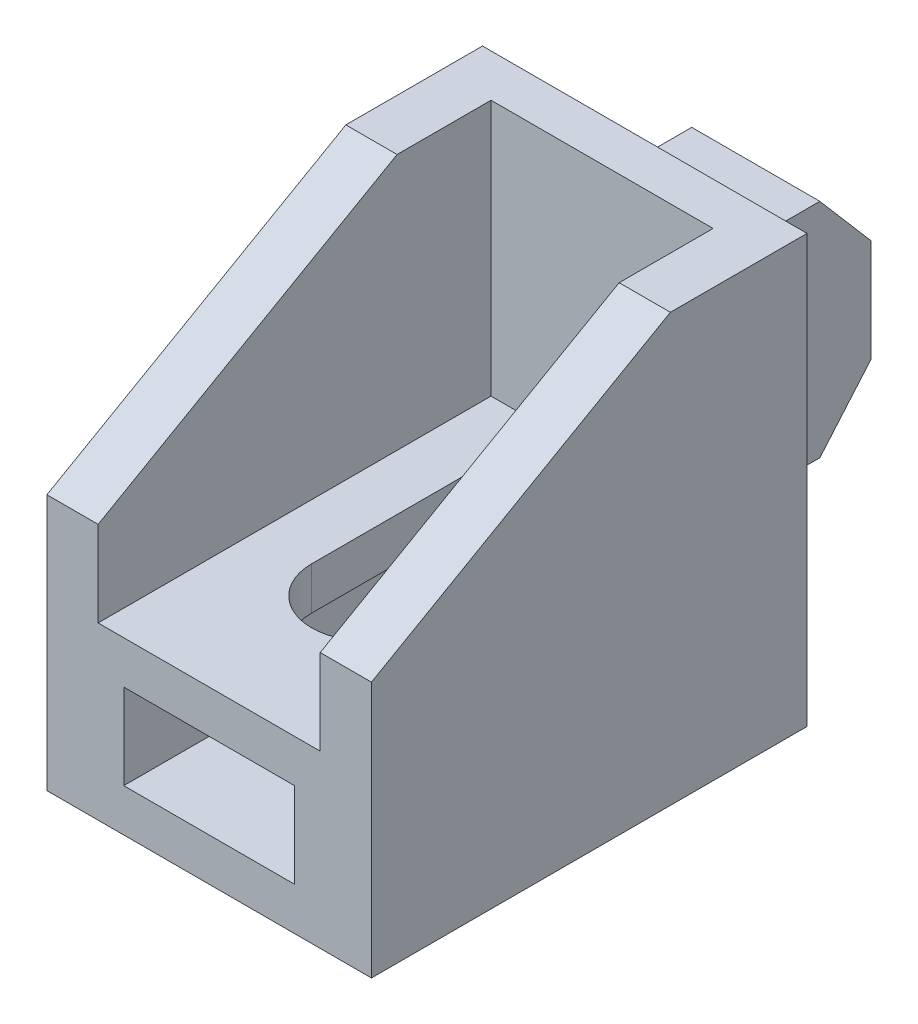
ISO-10303-21;
HEADER;
FILE_DESCRIPTION(('STEP AP214'),'2;1');
FILE_NAME('part.step','',(''),(''),'','','');
FILE_SCHEMA(('AUTOMOTIVE_DESIGN { 1 0 10303 214 1 1 1 1 }'));
ENDSEC;
DATA;
#1=APPLICATION_CONTEXT('core data for automotive mechanical design processes');
#2=APPLICATION_PROTOCOL_DEFINITION('international standard','automotive_design',2000,#1);
#3=PRODUCT_CONTEXT('',#1,'mechanical');
#4=PRODUCT('Part','Part','',(#3));
#5=PRODUCT_RELATED_PRODUCT_CATEGORY('part','',(#4));
#6=PRODUCT_DEFINITION_FORMATION('','',#4);
#7=PRODUCT_DEFINITION_CONTEXT('part definition',#1,'design');
#8=PRODUCT_DEFINITION('design','',#6,#7);
#9=PRODUCT_DEFINITION_SHAPE('','',#8);
#10=(LENGTH_UNIT() NAMED_UNIT(*) SI_UNIT(.MILLI.,.METRE.));
#11=(NAMED_UNIT(*) PLANE_ANGLE_UNIT() SI_UNIT($,.RADIAN.));
#12=(NAMED_UNIT(*) SI_UNIT($,.STERADIAN.) SOLID_ANGLE_UNIT());
#13=UNCERTAINTY_MEASURE_WITH_UNIT(LENGTH_MEASURE(1.E-05),#10,'distance_accuracy_value','');
#14=(GEOMETRIC_REPRESENTATION_CONTEXT(3) GLOBAL_UNCERTAINTY_ASSIGNED_CONTEXT((#13)) GLOBAL_UNIT_ASSIGNED_CONTEXT((#10,
#11,#12)) REPRESENTATION_CONTEXT('',''));
#15=CARTESIAN_POINT('',(0.,0.,0.));
#16=DIRECTION('',(0.,0.,1.));
#17=DIRECTION('',(1.,0.,0.));
#18=AXIS2_PLACEMENT_3D('',#15,#16,#17);
#19=CARTESIAN_POINT('',(0.,-2.99999999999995,7.25000000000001));
#20=DIRECTION('',(0.,-1.,0.));
#21=DIRECTION('',(0.,0.,-1.));
#22=AXIS2_PLACEMENT_3D('',#19,#20,#21);
#23=CYLINDRICAL_SURFACE('',#22,3.25);
#24=DIRECTION('',(0.,1.,0.));
#25=VECTOR('',#24,1.);
#26=CARTESIAN_POINT('',(-3.25,-2.99999999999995,7.25));
#27=LINE('',#26,#25);
#28=CARTESIAN_POINT('',(-3.25,-3.99999999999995,7.25));
#29=VERTEX_POINT('',#28);
#30=CARTESIAN_POINT('',(-3.25,-6.49999999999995,7.25));
#31=VERTEX_POINT('',#30);
#32=EDGE_CURVE('E237',#29,#31,#27,.F.);
#33=ORIENTED_EDGE('',*,*,#32,.T.);
#34=CARTESIAN_POINT('',(0.,-6.49999999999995,7.25000000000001));
#35=DIRECTION('',(0.,-1.,0.));
#36=DIRECTION('',(0.,0.,-1.));
#37=AXIS2_PLACEMENT_3D('',#34,#35,#36);
#38=CIRCLE('',#37,3.25);
#39=CARTESIAN_POINT('',(3.24999999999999,-6.49999999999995,7.25000000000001));
#40=VERTEX_POINT('',#39);
#41=EDGE_CURVE('E320',#31,#40,#38,.T.);
#42=ORIENTED_EDGE('',*,*,#41,.T.);
#43=DIRECTION('',(0.,1.,0.));
#44=VECTOR('',#43,1.);
#45=CARTESIAN_POINT('',(3.24999999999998,-2.99999999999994,7.25000000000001));
#46=LINE('',#45,#44);
#47=CARTESIAN_POINT('',(3.24999999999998,-3.99999999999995,7.25000000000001));
#48=VERTEX_POINT('',#47);
#49=EDGE_CURVE('E238',#40,#48,#46,.T.);
#50=ORIENTED_EDGE('',*,*,#49,.T.);
#51=CARTESIAN_POINT('',(0.,-3.99999999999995,7.25000000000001));
#52=DIRECTION('',(0.,-1.,0.));
#53=DIRECTION('',(0.,0.,-1.));
#54=AXIS2_PLACEMENT_3D('',#51,#52,#53);
#55=CIRCLE('',#54,3.25);
#56=EDGE_CURVE('E247',#48,#29,#55,.F.);
#57=ORIENTED_EDGE('',*,*,#56,.T.);
#58=EDGE_LOOP('',(#33,#42,#50,#57));
#59=FACE_BOUND('',#58,.T.);
#60=ADVANCED_FACE('F15',(#59),#23,.F.);
#61=CARTESIAN_POINT('',(3.24999999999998,-2.99999999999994,16.25));
#62=DIRECTION('',(1.,0.,0.));
#63=DIRECTION('',(0.,0.,-1.));
#64=AXIS2_PLACEMENT_3D('',#61,#62,#63);
#65=PLANE('',#64);
#66=ORIENTED_EDGE('',*,*,#49,.F.);
#67=DIRECTION('',(0.,0.,1.));
#68=VECTOR('',#67,1.);
#69=CARTESIAN_POINT('',(3.25000000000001,-6.49999999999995,2.50000000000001));
#70=LINE('',#69,#68);
#71=CARTESIAN_POINT('',(3.25000000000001,-6.49999999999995,16.25));
#72=VERTEX_POINT('',#71);
#73=EDGE_CURVE('E235',#40,#72,#70,.T.);
#74=ORIENTED_EDGE('',*,*,#73,.T.);
#75=DIRECTION('',(0.,-1.,0.));
#76=VECTOR('',#75,1.);
#77=CARTESIAN_POINT('',(3.25000000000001,-2.99999999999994,16.25));
#78=LINE('',#77,#76);
#79=CARTESIAN_POINT('',(3.24999999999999,-3.99999999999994,16.25));
#80=VERTEX_POINT('',#79);
#81=EDGE_CURVE('E228',#72,#80,#78,.F.);
#82=ORIENTED_EDGE('',*,*,#81,.T.);
#83=DIRECTION('',(0.,0.,-1.));
#84=VECTOR('',#83,1.);
#85=CARTESIAN_POINT('',(3.24999999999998,-3.99999999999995,2.5));
#86=LINE('',#85,#84);
#87=EDGE_CURVE('E232',#80,#48,#86,.T.);
#88=ORIENTED_EDGE('',*,*,#87,.T.);
#89=EDGE_LOOP('',(#66,#74,#82,#88));
#90=FACE_BOUND('',#89,.T.);
#91=ADVANCED_FACE('F230',(#90),#65,.F.);
#92=CARTESIAN_POINT('',(0.,-2.99999999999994,16.25));
#93=DIRECTION('',(0.,-1.,0.));
#94=DIRECTION('',(0.,0.,-1.));
#95=AXIS2_PLACEMENT_3D('',#92,#93,#94);
#96=CYLINDRICAL_SURFACE('',#95,3.25);
#97=ORIENTED_EDGE('',*,*,#81,.F.);
#98=CARTESIAN_POINT('',(0.,-6.49999999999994,16.25));
#99=DIRECTION('',(0.,-1.,0.));
#100=DIRECTION('',(0.,0.,-1.));
#101=AXIS2_PLACEMENT_3D('',#98,#99,#100);
#102=CIRCLE('',#101,3.25);
#103=CARTESIAN_POINT('',(-3.24999999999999,-6.49999999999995,16.25));
#104=VERTEX_POINT('',#103);
#105=EDGE_CURVE('E317',#72,#104,#102,.T.);
#106=ORIENTED_EDGE('',*,*,#105,.T.);
#107=DIRECTION('',(0.,1.,0.));
#108=VECTOR('',#107,1.);
#109=CARTESIAN_POINT('',(-3.25,-2.99999999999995,16.25));
#110=LINE('',#109,#108);
#111=CARTESIAN_POINT('',(-3.25,-3.99999999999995,16.25));
#112=VERTEX_POINT('',#111);
#113=EDGE_CURVE('E222',#104,#112,#110,.T.);
#114=ORIENTED_EDGE('',*,*,#113,.T.);
#115=CARTESIAN_POINT('',(0.,-3.99999999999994,16.25));
#116=DIRECTION('',(0.,-1.,0.));
#117=DIRECTION('',(0.,0.,-1.));
#118=AXIS2_PLACEMENT_3D('',#115,#116,#117);
#119=CIRCLE('',#118,3.25);
#120=EDGE_CURVE('E19',#112,#80,#119,.F.);
#121=ORIENTED_EDGE('',*,*,#120,.T.);
#122=EDGE_LOOP('',(#97,#106,#114,#121));
#123=FACE_BOUND('',#122,.T.);
#124=ADVANCED_FACE('F241',(#123),#96,.F.);
#125=CARTESIAN_POINT('',(-3.25,-2.99999999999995,7.25));
#126=DIRECTION('',(-1.,0.,0.));
#127=DIRECTION('',(0.,0.,1.));
#128=AXIS2_PLACEMENT_3D('',#125,#126,#127);
#129=PLANE('',#128);
#130=ORIENTED_EDGE('',*,*,#113,.F.);
#131=DIRECTION('',(0.,0.,1.));
#132=VECTOR('',#131,1.);
#133=CARTESIAN_POINT('',(-3.24999999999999,-6.49999999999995,2.50000000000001));
#134=LINE('',#133,#132);
#135=EDGE_CURVE('E319',#104,#31,#134,.F.);
#136=ORIENTED_EDGE('',*,*,#135,.T.);
#137=ORIENTED_EDGE('',*,*,#32,.F.);
#138=DIRECTION('',(0.,0.,-1.));
#139=VECTOR('',#138,1.);
#140=CARTESIAN_POINT('',(-3.25,-3.99999999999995,2.5));
#141=LINE('',#140,#139);
#142=EDGE_CURVE('E249',#29,#112,#141,.F.);
#143=ORIENTED_EDGE('',*,*,#142,.T.);
#144=EDGE_LOOP('',(#130,#136,#137,#143));
#145=FACE_BOUND('',#144,.T.);
#146=ADVANCED_FACE('F337',(#145),#129,.F.);
#147=CARTESIAN_POINT('',(0.,-8.99999999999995,2.50000000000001));
#148=DIRECTION('',(0.,0.,-1.));
#149=DIRECTION('',(-1.,0.,0.));
#150=AXIS2_PLACEMENT_3D('',#147,#148,#149);
#151=PLANE('',#150);
#152=DIRECTION('',(1.,0.,0.));
#153=VECTOR('',#152,1.);
#154=CARTESIAN_POINT('',(6.50000000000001,-11.5,2.50000000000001));
#155=LINE('',#154,#153);
#156=CARTESIAN_POINT('',(-5.,-11.5,2.50000000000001));
#157=VERTEX_POINT('',#156);
#158=CARTESIAN_POINT('',(5.00000000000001,-11.5,2.50000000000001));
#159=VERTEX_POINT('',#158);
#160=EDGE_CURVE('E352',#157,#159,#155,.T.);
#161=ORIENTED_EDGE('',*,*,#160,.T.);
#162=DIRECTION('',(0.,1.,0.));
#163=VECTOR('',#162,1.);
#164=CARTESIAN_POINT('',(5.00000000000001,-11.5,2.5));
#165=LINE('',#164,#163);
#166=CARTESIAN_POINT('',(5.00000000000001,-6.49999999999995,2.50000000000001));
#167=VERTEX_POINT('',#166);
#168=EDGE_CURVE('E345',#167,#159,#165,.F.);
#169=ORIENTED_EDGE('',*,*,#168,.F.);
#170=DIRECTION('',(1.,0.,0.));
#171=VECTOR('',#170,1.);
#172=CARTESIAN_POINT('',(-6.5,-6.49999999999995,2.5));
#173=LINE('',#172,#171);
#174=CARTESIAN_POINT('',(-5.,-6.49999999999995,2.50000000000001));
#175=VERTEX_POINT('',#174);
#176=EDGE_CURVE('E325',#167,#175,#173,.F.);
#177=ORIENTED_EDGE('',*,*,#176,.T.);
#178=DIRECTION('',(0.,1.,0.));
#179=VECTOR('',#178,1.);
#180=CARTESIAN_POINT('',(-5.,-8.99999999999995,2.50000000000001));
#181=LINE('',#180,#179);
#182=EDGE_CURVE('E331',#157,#175,#181,.T.);
#183=ORIENTED_EDGE('',*,*,#182,.F.);
#184=EDGE_LOOP('',(#161,#169,#177,#183));
#185=FACE_BOUND('',#184,.T.);
#186=ADVANCED_FACE('F746',(#185),#151,.F.);
#187=CARTESIAN_POINT('',(3.75,-6.50000000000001,-6.5));
#188=DIRECTION('',(0.,-0.650791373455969,-0.759256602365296));
#189=DIRECTION('',(0.,0.759256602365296,-0.650791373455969));
#190=AXIS2_PLACEMENT_3D('',#187,#188,#189);
#191=PLANE('',#190);
#192=DIRECTION('',(0.,-0.759256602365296,0.650791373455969));
#193=VECTOR('',#192,1.);
#194=CARTESIAN_POINT('',(3.75,-3.,-9.5));
#195=LINE('',#194,#193);
#196=CARTESIAN_POINT('',(3.75,-3.,-9.5));
#197=VERTEX_POINT('',#196);
#198=CARTESIAN_POINT('',(3.75,-6.5,-6.5));
#199=VERTEX_POINT('',#198);
#200=EDGE_CURVE('E376',#197,#199,#195,.T.);
#201=ORIENTED_EDGE('',*,*,#200,.T.);
#202=DIRECTION('',(1.,0.,0.));
#203=VECTOR('',#202,1.);
#204=CARTESIAN_POINT('',(3.75,-6.50000000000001,-6.49999999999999));
#205=LINE('',#204,#203);
#206=CARTESIAN_POINT('',(-3.75,-6.50000000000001,-6.49999999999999));
#207=VERTEX_POINT('',#206);
#208=EDGE_CURVE('E269',#207,#199,#205,.T.);
#209=ORIENTED_EDGE('',*,*,#208,.F.);
#210=DIRECTION('',(0.,0.759256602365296,-0.650791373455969));
#211=VECTOR('',#210,1.);
#212=CARTESIAN_POINT('',(-3.75,-6.5,-6.49999999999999));
#213=LINE('',#212,#211);
#214=CARTESIAN_POINT('',(-3.75,-3.,-9.5));
#215=VERTEX_POINT('',#214);
#216=EDGE_CURVE('E278',#207,#215,#213,.T.);
#217=ORIENTED_EDGE('',*,*,#216,.T.);
#218=DIRECTION('',(-1.,0.,0.));
#219=VECTOR('',#218,1.);
#220=CARTESIAN_POINT('',(0.,-3.00000000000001,-9.5));
#221=LINE('',#220,#219);
#222=EDGE_CURVE('E264',#197,#215,#221,.T.);
#223=ORIENTED_EDGE('',*,*,#222,.F.);
#224=EDGE_LOOP('',(#201,#209,#217,#223));
#225=FACE_BOUND('',#224,.T.);
#226=ADVANCED_FACE('F711',(#225),#191,.T.);
#227=CARTESIAN_POINT('',(3.75,-6.50000000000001,-4.5));
#228=DIRECTION('',(0.,-1.,0.));
#229=DIRECTION('',(0.,0.,-1.));
#230=AXIS2_PLACEMENT_3D('',#227,#228,#229);
#231=PLANE('',#230);
#232=DIRECTION('',(0.,0.,1.));
#233=VECTOR('',#232,1.);
#234=CARTESIAN_POINT('',(3.75,-6.5,-7.));
#235=LINE('',#234,#233);
#236=CARTESIAN_POINT('',(3.75,-6.5,-4.5));
#237=VERTEX_POINT('',#236);
#238=EDGE_CURVE('E378',#199,#237,#235,.T.);
#239=ORIENTED_EDGE('',*,*,#238,.T.);
#240=DIRECTION('',(1.,0.,0.));
#241=VECTOR('',#240,1.);
#242=CARTESIAN_POINT('',(0.,-6.50000000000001,-4.5));
#243=LINE('',#242,#241);
#244=CARTESIAN_POINT('',(-3.75,-6.5,-4.49999999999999));
#245=VERTEX_POINT('',#244);
#246=EDGE_CURVE('E244',#245,#237,#243,.T.);
#247=ORIENTED_EDGE('',*,*,#246,.F.);
#248=DIRECTION('',(0.,0.,-1.));
#249=VECTOR('',#248,1.);
#250=CARTESIAN_POINT('',(-3.75,-6.50000000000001,-4.74999999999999));
#251=LINE('',#250,#249);
#252=EDGE_CURVE('E275',#245,#207,#251,.T.);
#253=ORIENTED_EDGE('',*,*,#252,.T.);
#254=ORIENTED_EDGE('',*,*,#208,.T.);
#255=EDGE_LOOP('',(#239,#247,#253,#254));
#256=FACE_BOUND('',#255,.T.);
#257=ADVANCED_FACE('F714',(#256),#231,.T.);
#258=CARTESIAN_POINT('',(-3.75,6.5,-4.5));
#259=DIRECTION('',(0.,0.,1.));
#260=DIRECTION('',(0.,-1.,0.));
#261=AXIS2_PLACEMENT_3D('',#258,#259,#260);
#262=PLANE('',#261);
#263=DIRECTION('',(1.,0.,0.));
#264=VECTOR('',#263,1.);
#265=CARTESIAN_POINT('',(3.75,6.5,-4.5));
#266=LINE('',#265,#264);
#267=CARTESIAN_POINT('',(-3.75,6.5,-4.5));
#268=VERTEX_POINT('',#267);
#269=CARTESIAN_POINT('',(3.75,6.5,-4.5));
#270=VERTEX_POINT('',#269);
#271=EDGE_CURVE('E265',#268,#270,#266,.T.);
#272=ORIENTED_EDGE('',*,*,#271,.F.);
#273=DIRECTION('',(0.,-1.,0.));
#274=VECTOR('',#273,1.);
#275=CARTESIAN_POINT('',(-3.75,0.,-4.5));
#276=LINE('',#275,#274);
#277=CARTESIAN_POINT('',(-3.75,4.00000000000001,-4.5));
#278=VERTEX_POINT('',#277);
#279=EDGE_CURVE('E294',#268,#278,#276,.T.);
#280=ORIENTED_EDGE('',*,*,#279,.T.);
#281=DIRECTION('',(1.,0.,0.));
#282=VECTOR('',#281,1.);
#283=CARTESIAN_POINT('',(-3.25,4.00000000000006,-4.5));
#284=LINE('',#283,#282);
#285=CARTESIAN_POINT('',(3.75,4.00000000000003,-4.5));
#286=VERTEX_POINT('',#285);
#287=EDGE_CURVE('E315',#286,#278,#284,.F.);
#288=ORIENTED_EDGE('',*,*,#287,.F.);
#289=DIRECTION('',(0.,1.,0.));
#290=VECTOR('',#289,1.);
#291=CARTESIAN_POINT('',(3.75,-2.49999999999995,-4.5));
#292=LINE('',#291,#290);
#293=EDGE_CURVE('E385',#286,#270,#292,.T.);
#294=ORIENTED_EDGE('',*,*,#293,.T.);
#295=EDGE_LOOP('',(#272,#280,#288,#294));
#296=FACE_BOUND('',#295,.T.);
#297=ADVANCED_FACE('F727',(#296),#262,.T.);
#298=CARTESIAN_POINT('',(3.75,6.5,-6.5));
#299=DIRECTION('',(0.,1.,0.));
#300=DIRECTION('',(0.,0.,1.));
#301=AXIS2_PLACEMENT_3D('',#298,#299,#300);
#302=PLANE('',#301);
#303=DIRECTION('',(0.,0.,1.));
#304=VECTOR('',#303,1.);
#305=CARTESIAN_POINT('',(3.75,6.5,-7.));
#306=LINE('',#305,#304);
#307=CARTESIAN_POINT('',(3.75,6.5,-6.50000000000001));
#308=VERTEX_POINT('',#307);
#309=EDGE_CURVE('E387',#270,#308,#306,.F.);
#310=ORIENTED_EDGE('',*,*,#309,.T.);
#311=DIRECTION('',(1.,0.,0.));
#312=VECTOR('',#311,1.);
#313=CARTESIAN_POINT('',(3.75,6.50000000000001,-6.50000000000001));
#314=LINE('',#313,#312);
#315=CARTESIAN_POINT('',(-3.75,6.50000000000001,-6.50000000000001));
#316=VERTEX_POINT('',#315);
#317=EDGE_CURVE('E268',#316,#308,#314,.T.);
#318=ORIENTED_EDGE('',*,*,#317,.F.);
#319=DIRECTION('',(0.,0.,1.));
#320=VECTOR('',#319,1.);
#321=CARTESIAN_POINT('',(-3.75,6.50000000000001,-4.75));
#322=LINE('',#321,#320);
#323=EDGE_CURVE('E291',#316,#268,#322,.T.);
#324=ORIENTED_EDGE('',*,*,#323,.T.);
#325=ORIENTED_EDGE('',*,*,#271,.T.);
#326=EDGE_LOOP('',(#310,#318,#324,#325));
#327=FACE_BOUND('',#326,.T.);
#328=ADVANCED_FACE('F729',(#327),#302,.T.);
#329=CARTESIAN_POINT('',(3.75,3.,-9.5));
#330=DIRECTION('',(0.,0.650791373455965,-0.7592566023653));
#331=DIRECTION('',(0.,0.7592566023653,0.650791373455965));
#332=AXIS2_PLACEMENT_3D('',#329,#330,#331);
#333=PLANE('',#332);
#334=DIRECTION('',(0.,-0.759256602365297,-0.650791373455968));
#335=VECTOR('',#334,1.);
#336=CARTESIAN_POINT('',(3.75,6.5,-6.5));
#337=LINE('',#336,#335);
#338=CARTESIAN_POINT('',(3.75,3.,-9.5));
#339=VERTEX_POINT('',#338);
#340=EDGE_CURVE('E389',#308,#339,#337,.T.);
#341=ORIENTED_EDGE('',*,*,#340,.T.);
#342=DIRECTION('',(1.,0.,0.));
#343=VECTOR('',#342,1.);
#344=CARTESIAN_POINT('',(0.,3.,-9.5));
#345=LINE('',#344,#343);
#346=CARTESIAN_POINT('',(-3.75,2.99999999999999,-9.5));
#347=VERTEX_POINT('',#346);
#348=EDGE_CURVE('E282',#347,#339,#345,.T.);
#349=ORIENTED_EDGE('',*,*,#348,.F.);
#350=DIRECTION('',(0.,0.7592566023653,0.650791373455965));
#351=VECTOR('',#350,1.);
#352=CARTESIAN_POINT('',(-3.75,3.,-9.5));
#353=LINE('',#352,#351);
#354=EDGE_CURVE('E286',#347,#316,#353,.T.);
#355=ORIENTED_EDGE('',*,*,#354,.T.);
#356=ORIENTED_EDGE('',*,*,#317,.T.);
#357=EDGE_LOOP('',(#341,#349,#355,#356));
#358=FACE_BOUND('',#357,.T.);
#359=ADVANCED_FACE('F733',(#358),#333,.T.);
#360=CARTESIAN_POINT('',(-3.75,-3.00000000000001,-9.49999999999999));
#361=DIRECTION('',(0.,0.,-1.));
#362=DIRECTION('',(0.,1.,0.));
#363=AXIS2_PLACEMENT_3D('',#360,#361,#362);
#364=PLANE('',#363);
#365=DIRECTION('',(0.,1.,0.));
#366=VECTOR('',#365,1.);
#367=CARTESIAN_POINT('',(3.75,-2.49999999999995,-9.5));
#368=LINE('',#367,#366);
#369=EDGE_CURVE('E391',#339,#197,#368,.F.);
#370=ORIENTED_EDGE('',*,*,#369,.T.);
#371=ORIENTED_EDGE('',*,*,#222,.T.);
#372=DIRECTION('',(0.,1.,0.));
#373=VECTOR('',#372,1.);
#374=CARTESIAN_POINT('',(-3.75,0.,-9.5));
#375=LINE('',#374,#373);
#376=EDGE_CURVE('E283',#215,#347,#375,.T.);
#377=ORIENTED_EDGE('',*,*,#376,.T.);
#378=ORIENTED_EDGE('',*,*,#348,.T.);
#379=EDGE_LOOP('',(#370,#371,#377,#378));
#380=FACE_BOUND('',#379,.T.);
#381=ADVANCED_FACE('F539',(#380),#364,.T.);
#382=CARTESIAN_POINT('',(-3.75,-3.99999999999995,-4.49999999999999));
#383=DIRECTION('',(0.,0.,1.));
#384=DIRECTION('',(0.,-1.,0.));
#385=AXIS2_PLACEMENT_3D('',#382,#383,#384);
#386=PLANE('',#385);
#387=ORIENTED_EDGE('',*,*,#246,.T.);
#388=DIRECTION('',(0.,1.,0.));
#389=VECTOR('',#388,1.);
#390=CARTESIAN_POINT('',(3.75,-2.49999999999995,-4.5));
#391=LINE('',#390,#389);
#392=CARTESIAN_POINT('',(3.75,-3.99999999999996,-4.5));
#393=VERTEX_POINT('',#392);
#394=EDGE_CURVE('E380',#237,#393,#391,.T.);
#395=ORIENTED_EDGE('',*,*,#394,.T.);
#396=DIRECTION('',(1.,0.,0.));
#397=VECTOR('',#396,1.);
#398=CARTESIAN_POINT('',(3.25,-3.99999999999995,-4.49999999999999));
#399=LINE('',#398,#397);
#400=CARTESIAN_POINT('',(-3.75,-3.99999999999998,-4.49999999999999));
#401=VERTEX_POINT('',#400);
#402=EDGE_CURVE('E397',#401,#393,#399,.T.);
#403=ORIENTED_EDGE('',*,*,#402,.F.);
#404=DIRECTION('',(0.,-1.,0.));
#405=VECTOR('',#404,1.);
#406=CARTESIAN_POINT('',(-3.75,0.,-4.5));
#407=LINE('',#406,#405);
#408=EDGE_CURVE('E279',#401,#245,#407,.T.);
#409=ORIENTED_EDGE('',*,*,#408,.T.);
#410=EDGE_LOOP('',(#387,#395,#403,#409));
#411=FACE_BOUND('',#410,.T.);
#412=ADVANCED_FACE('F531',(#411),#386,.T.);
#413=CARTESIAN_POINT('',(6.50000000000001,-3.99999999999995,2.5));
#414=DIRECTION('',(0.,-1.,0.));
#415=DIRECTION('',(0.,0.,-1.));
#416=AXIS2_PLACEMENT_3D('',#413,#414,#415);
#417=PLANE('',#416);
#418=ORIENTED_EDGE('',*,*,#56,.F.);
#419=ORIENTED_EDGE('',*,*,#87,.F.);
#420=ORIENTED_EDGE('',*,*,#120,.F.);
#421=ORIENTED_EDGE('',*,*,#142,.F.);
#422=EDGE_LOOP('',(#418,#419,#420,#421));
#423=FACE_BOUND('',#422,.T.);
#424=DIRECTION('',(1.,0.,0.));
#425=VECTOR('',#424,1.);
#426=CARTESIAN_POINT('',(0.,-3.99999999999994,25.5));
#427=LINE('',#426,#425);
#428=CARTESIAN_POINT('',(6.50000000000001,-3.99999999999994,25.5));
#429=VERTEX_POINT('',#428);
#430=CARTESIAN_POINT('',(-6.49999999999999,-3.99999999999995,25.5));
#431=VERTEX_POINT('',#430);
#432=EDGE_CURVE('E417',#429,#431,#427,.F.);
#433=ORIENTED_EDGE('',*,*,#432,.F.);
#434=DIRECTION('',(0.,0.,-1.));
#435=VECTOR('',#434,1.);
#436=CARTESIAN_POINT('',(6.50000000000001,-3.99999999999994,2.49999999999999));
#437=LINE('',#436,#435);
#438=CARTESIAN_POINT('',(6.5,-3.99999999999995,2.50000000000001));
#439=VERTEX_POINT('',#438);
#440=EDGE_CURVE('E358',#429,#439,#437,.T.);
#441=ORIENTED_EDGE('',*,*,#440,.T.);
#442=DIRECTION('',(-1.,0.,0.));
#443=VECTOR('',#442,1.);
#444=CARTESIAN_POINT('',(0.,-3.99999999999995,2.5));
#445=LINE('',#444,#443);
#446=CARTESIAN_POINT('',(-6.5,-3.99999999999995,2.5));
#447=VERTEX_POINT('',#446);
#448=EDGE_CURVE('E356',#439,#447,#445,.T.);
#449=ORIENTED_EDGE('',*,*,#448,.T.);
#450=DIRECTION('',(0.,0.,1.));
#451=VECTOR('',#450,1.);
#452=CARTESIAN_POINT('',(-6.5,-3.99999999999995,2.50000000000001));
#453=LINE('',#452,#451);
#454=EDGE_CURVE('E295',#447,#431,#453,.T.);
#455=ORIENTED_EDGE('',*,*,#454,.T.);
#456=EDGE_LOOP('',(#433,#441,#449,#455));
#457=FACE_BOUND('',#456,.T.);
#458=ADVANCED_FACE('F245',(#423,#457),#417,.F.);
#459=CARTESIAN_POINT('',(-4.99999999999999,-11.5,25.5));
#460=DIRECTION('',(1.,0.,0.));
#461=DIRECTION('',(0.,0.,-1.));
#462=AXIS2_PLACEMENT_3D('',#459,#460,#461);
#463=PLANE('',#462);
#464=ORIENTED_EDGE('',*,*,#182,.T.);
#465=DIRECTION('',(0.,0.,1.));
#466=VECTOR('',#465,1.);
#467=CARTESIAN_POINT('',(-5.,-6.49999999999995,2.50000000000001));
#468=LINE('',#467,#466);
#469=CARTESIAN_POINT('',(-4.99999999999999,-6.49999999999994,25.5));
#470=VERTEX_POINT('',#469);
#471=EDGE_CURVE('E321',#175,#470,#468,.T.);
#472=ORIENTED_EDGE('',*,*,#471,.T.);
#473=DIRECTION('',(0.,1.,0.));
#474=VECTOR('',#473,1.);
#475=CARTESIAN_POINT('',(-4.99999999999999,-1.49999999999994,25.5));
#476=LINE('',#475,#474);
#477=CARTESIAN_POINT('',(-4.99999999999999,-11.5,25.5));
#478=VERTEX_POINT('',#477);
#479=EDGE_CURVE('E422',#478,#470,#476,.T.);
#480=ORIENTED_EDGE('',*,*,#479,.F.);
#481=DIRECTION('',(0.,0.,-1.));
#482=VECTOR('',#481,1.);
#483=CARTESIAN_POINT('',(-4.99999999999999,-11.5,2.50000000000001));
#484=LINE('',#483,#482);
#485=EDGE_CURVE('E350',#478,#157,#484,.T.);
#486=ORIENTED_EDGE('',*,*,#485,.T.);
#487=EDGE_LOOP('',(#464,#472,#480,#486));
#488=FACE_BOUND('',#487,.T.);
#489=ADVANCED_FACE('F530',(#488),#463,.T.);
#490=CARTESIAN_POINT('',(-6.5,-6.49999999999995,2.50000000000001));
#491=DIRECTION('',(0.,1.,0.));
#492=DIRECTION('',(0.,0.,1.));
#493=AXIS2_PLACEMENT_3D('',#490,#491,#492);
#494=PLANE('',#493);
#495=ORIENTED_EDGE('',*,*,#105,.F.);
#496=ORIENTED_EDGE('',*,*,#73,.F.);
#497=ORIENTED_EDGE('',*,*,#41,.F.);
#498=ORIENTED_EDGE('',*,*,#135,.F.);
#499=EDGE_LOOP('',(#495,#496,#497,#498));
#500=FACE_BOUND('',#499,.T.);
#501=ORIENTED_EDGE('',*,*,#176,.F.);
#502=DIRECTION('',(0.,0.,1.));
#503=VECTOR('',#502,1.);
#504=CARTESIAN_POINT('',(5.00000000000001,-6.49999999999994,2.50000000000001));
#505=LINE('',#504,#503);
#506=CARTESIAN_POINT('',(5.00000000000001,-6.49999999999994,25.5));
#507=VERTEX_POINT('',#506);
#508=EDGE_CURVE('E343',#507,#167,#505,.F.);
#509=ORIENTED_EDGE('',*,*,#508,.F.);
#510=DIRECTION('',(1.,0.,0.));
#511=VECTOR('',#510,1.);
#512=CARTESIAN_POINT('',(0.,-6.49999999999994,25.5));
#513=LINE('',#512,#511);
#514=EDGE_CURVE('E425',#470,#507,#513,.T.);
#515=ORIENTED_EDGE('',*,*,#514,.F.);
#516=ORIENTED_EDGE('',*,*,#471,.F.);
#517=EDGE_LOOP('',(#501,#509,#515,#516));
#518=FACE_BOUND('',#517,.T.);
#519=ADVANCED_FACE('F341',(#500,#518),#494,.F.);
#520=CARTESIAN_POINT('',(5.00000000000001,-11.5,2.50000000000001));
#521=DIRECTION('',(-1.,0.,0.));
#522=DIRECTION('',(0.,0.,1.));
#523=AXIS2_PLACEMENT_3D('',#520,#521,#522);
#524=PLANE('',#523);
#525=ORIENTED_EDGE('',*,*,#168,.T.);
#526=DIRECTION('',(0.,0.,-1.));
#527=VECTOR('',#526,1.);
#528=CARTESIAN_POINT('',(5.00000000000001,-11.5,2.50000000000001));
#529=LINE('',#528,#527);
#530=CARTESIAN_POINT('',(5.00000000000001,-11.5,25.5));
#531=VERTEX_POINT('',#530);
#532=EDGE_CURVE('E354',#159,#531,#529,.F.);
#533=ORIENTED_EDGE('',*,*,#532,.T.);
#534=DIRECTION('',(0.,1.,0.));
#535=VECTOR('',#534,1.);
#536=CARTESIAN_POINT('',(5.00000000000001,-1.49999999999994,25.5));
#537=LINE('',#536,#535);
#538=EDGE_CURVE('E428',#507,#531,#537,.F.);
#539=ORIENTED_EDGE('',*,*,#538,.F.);
#540=ORIENTED_EDGE('',*,*,#508,.T.);
#541=EDGE_LOOP('',(#525,#533,#539,#540));
#542=FACE_BOUND('',#541,.T.);
#543=ADVANCED_FACE('F601',(#542),#524,.T.);
#544=CARTESIAN_POINT('',(6.50000000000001,-11.5,2.50000000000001));
#545=DIRECTION('',(0.,-1.,0.));
#546=DIRECTION('',(0.,0.,-1.));
#547=AXIS2_PLACEMENT_3D('',#544,#545,#546);
#548=PLANE('',#547);
#549=CARTESIAN_POINT('',(0.,-11.5,7.25000000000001));
#550=DIRECTION('',(0.,-1.,0.));
#551=DIRECTION('',(0.,0.,-1.));
#552=AXIS2_PLACEMENT_3D('',#549,#550,#551);
#553=CIRCLE('',#552,3.25);
#554=CARTESIAN_POINT('',(-3.25,-11.5,7.25000000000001));
#555=VERTEX_POINT('',#554);
#556=CARTESIAN_POINT('',(3.24999999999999,-11.5,7.25000000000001));
#557=VERTEX_POINT('',#556);
#558=EDGE_CURVE('E305',#555,#557,#553,.T.);
#559=ORIENTED_EDGE('',*,*,#558,.T.);
#560=DIRECTION('',(0.,0.,-1.));
#561=VECTOR('',#560,1.);
#562=CARTESIAN_POINT('',(3.24999999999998,-11.5,16.25));
#563=LINE('',#562,#561);
#564=CARTESIAN_POINT('',(3.24999999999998,-11.4999999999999,16.25));
#565=VERTEX_POINT('',#564);
#566=EDGE_CURVE('E257',#557,#565,#563,.F.);
#567=ORIENTED_EDGE('',*,*,#566,.T.);
#568=CARTESIAN_POINT('',(0.,-11.4999999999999,16.25));
#569=DIRECTION('',(0.,-1.,0.));
#570=DIRECTION('',(0.,0.,-1.));
#571=AXIS2_PLACEMENT_3D('',#568,#569,#570);
#572=CIRCLE('',#571,3.25);
#573=CARTESIAN_POINT('',(-3.25,-11.4999999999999,16.25));
#574=VERTEX_POINT('',#573);
#575=EDGE_CURVE('E310',#565,#574,#572,.T.);
#576=ORIENTED_EDGE('',*,*,#575,.T.);
#577=DIRECTION('',(0.,0.,1.));
#578=VECTOR('',#577,1.);
#579=CARTESIAN_POINT('',(-3.25,-11.4999999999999,7.25));
#580=LINE('',#579,#578);
#581=EDGE_CURVE('E253',#574,#555,#580,.F.);
#582=ORIENTED_EDGE('',*,*,#581,.T.);
#583=EDGE_LOOP('',(#559,#567,#576,#582));
#584=FACE_BOUND('',#583,.T.);
#585=ORIENTED_EDGE('',*,*,#160,.F.);
#586=ORIENTED_EDGE('',*,*,#485,.F.);
#587=DIRECTION('',(1.,0.,0.));
#588=VECTOR('',#587,1.);
#589=CARTESIAN_POINT('',(0.,-11.4999999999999,25.5));
#590=LINE('',#589,#588);
#591=EDGE_CURVE('E431',#531,#478,#590,.F.);
#592=ORIENTED_EDGE('',*,*,#591,.F.);
#593=ORIENTED_EDGE('',*,*,#532,.F.);
#594=EDGE_LOOP('',(#585,#586,#592,#593));
#595=FACE_BOUND('',#594,.T.);
#596=ADVANCED_FACE('F598',(#584,#595),#548,.F.);
#597=CARTESIAN_POINT('',(0.,6.50955553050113,2.5));
#598=DIRECTION('',(0.,0.,-1.));
#599=DIRECTION('',(-1.,0.,0.));
#600=AXIS2_PLACEMENT_3D('',#597,#598,#599);
#601=PLANE('',#600);
#602=ORIENTED_EDGE('',*,*,#448,.F.);
#603=DIRECTION('',(0.,1.,0.));
#604=VECTOR('',#603,1.);
#605=CARTESIAN_POINT('',(6.50000000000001,17.0191110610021,2.5));
#606=LINE('',#605,#604);
#607=CARTESIAN_POINT('',(6.5,11.0000000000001,2.5));
#608=VERTEX_POINT('',#607);
#609=EDGE_CURVE('E360',#439,#608,#606,.T.);
#610=ORIENTED_EDGE('',*,*,#609,.T.);
#611=DIRECTION('',(1.,0.,0.));
#612=VECTOR('',#611,1.);
#613=CARTESIAN_POINT('',(9.50000000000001,11.0000000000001,2.5));
#614=LINE('',#613,#612);
#615=CARTESIAN_POINT('',(-6.5,11.0000000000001,2.5));
#616=VERTEX_POINT('',#615);
#617=EDGE_CURVE('E439',#616,#608,#614,.T.);
#618=ORIENTED_EDGE('',*,*,#617,.F.);
#619=DIRECTION('',(0.,1.,0.));
#620=VECTOR('',#619,1.);
#621=CARTESIAN_POINT('',(-6.5,-3.99999999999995,2.5));
#622=LINE('',#621,#620);
#623=EDGE_CURVE('E364',#616,#447,#622,.F.);
#624=ORIENTED_EDGE('',*,*,#623,.T.);
#625=EDGE_LOOP('',(#602,#610,#618,#624));
#626=FACE_BOUND('',#625,.T.);
#627=ADVANCED_FACE('F520',(#626),#601,.F.);
#628=CARTESIAN_POINT('',(6.50000000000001,17.0191110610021,2.49999999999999));
#629=DIRECTION('',(1.,0.,0.));
#630=DIRECTION('',(0.,0.,-1.));
#631=AXIS2_PLACEMENT_3D('',#628,#629,#630);
#632=PLANE('',#631);
#633=ORIENTED_EDGE('',*,*,#440,.F.);
#634=DIRECTION('',(0.,1.,0.));
#635=VECTOR('',#634,1.);
#636=CARTESIAN_POINT('',(6.50000000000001,-1.49999999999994,25.5));
#637=LINE('',#636,#635);
#638=CARTESIAN_POINT('',(6.50000000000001,1.00000000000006,25.5));
#639=VERTEX_POINT('',#638);
#640=EDGE_CURVE('E414',#639,#429,#637,.F.);
#641=ORIENTED_EDGE('',*,*,#640,.F.);
#642=DIRECTION('',(0.,-0.496138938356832,0.86824314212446));
#643=VECTOR('',#642,1.);
#644=CARTESIAN_POINT('',(6.5,6.00000000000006,16.75));
#645=LINE('',#644,#643);
#646=CARTESIAN_POINT('',(6.5,11.0000000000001,7.99999999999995));
#647=VERTEX_POINT('',#646);
#648=EDGE_CURVE('E362',#647,#639,#645,.T.);
#649=ORIENTED_EDGE('',*,*,#648,.F.);
#650=DIRECTION('',(0.,0.,1.));
#651=VECTOR('',#650,1.);
#652=CARTESIAN_POINT('',(6.5,11.0000000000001,25.5));
#653=LINE('',#652,#651);
#654=EDGE_CURVE('E442',#608,#647,#653,.T.);
#655=ORIENTED_EDGE('',*,*,#654,.F.);
#656=ORIENTED_EDGE('',*,*,#609,.F.);
#657=EDGE_LOOP('',(#633,#641,#649,#655,#656));
#658=FACE_BOUND('',#657,.T.);
#659=ADVANCED_FACE('F524',(#658),#632,.F.);
#660=CARTESIAN_POINT('',(6.5,11.0000000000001,7.99999999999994));
#661=DIRECTION('',(0.,0.86824314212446,0.496138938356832));
#662=DIRECTION('',(0.,-0.496138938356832,0.86824314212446));
#663=AXIS2_PLACEMENT_3D('',#660,#661,#662);
#664=PLANE('',#663);
#665=DIRECTION('',(1.,0.,0.));
#666=VECTOR('',#665,1.);
#667=CARTESIAN_POINT('',(0.,1.00000000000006,25.5));
#668=LINE('',#667,#666);
#669=CARTESIAN_POINT('',(9.50000000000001,1.00000000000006,25.5));
#670=VERTEX_POINT('',#669);
#671=EDGE_CURVE('E411',#670,#639,#668,.F.);
#672=ORIENTED_EDGE('',*,*,#671,.F.);
#673=DIRECTION('',(0.,-0.496138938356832,0.86824314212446));
#674=VECTOR('',#673,1.);
#675=CARTESIAN_POINT('',(9.50000000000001,11.0000000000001,7.99999999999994));
#676=LINE('',#675,#674);
#677=CARTESIAN_POINT('',(9.50000000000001,11.0000000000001,7.99999999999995));
#678=VERTEX_POINT('',#677);
#679=EDGE_CURVE('E256',#678,#670,#676,.T.);
#680=ORIENTED_EDGE('',*,*,#679,.F.);
#681=DIRECTION('',(1.,0.,0.));
#682=VECTOR('',#681,1.);
#683=CARTESIAN_POINT('',(9.50000000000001,11.0000000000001,7.99999999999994));
#684=LINE('',#683,#682);
#685=EDGE_CURVE('E445',#647,#678,#684,.T.);
#686=ORIENTED_EDGE('',*,*,#685,.F.);
#687=ORIENTED_EDGE('',*,*,#648,.T.);
#688=EDGE_LOOP('',(#672,#680,#686,#687));
#689=FACE_BOUND('',#688,.T.);
#690=ADVANCED_FACE('F527',(#689),#664,.T.);
#691=CARTESIAN_POINT('',(-6.5,-3.99999999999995,2.50000000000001));
#692=DIRECTION('',(-1.,0.,0.));
#693=DIRECTION('',(0.,0.,1.));
#694=AXIS2_PLACEMENT_3D('',#691,#692,#693);
#695=PLANE('',#694);
#696=ORIENTED_EDGE('',*,*,#623,.F.);
#697=DIRECTION('',(0.,0.,1.));
#698=VECTOR('',#697,1.);
#699=CARTESIAN_POINT('',(-6.5,11.0000000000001,25.5));
#700=LINE('',#699,#698);
#701=CARTESIAN_POINT('',(-6.5,11.0000000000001,7.99999999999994));
#702=VERTEX_POINT('',#701);
#703=EDGE_CURVE('E454',#702,#616,#700,.F.);
#704=ORIENTED_EDGE('',*,*,#703,.F.);
#705=DIRECTION('',(0.,-0.496138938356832,0.86824314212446));
#706=VECTOR('',#705,1.);
#707=CARTESIAN_POINT('',(-6.49999999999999,11.0000000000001,7.99999999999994));
#708=LINE('',#707,#706);
#709=CARTESIAN_POINT('',(-6.5,1.00000000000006,25.5));
#710=VERTEX_POINT('',#709);
#711=EDGE_CURVE('E437',#710,#702,#708,.F.);
#712=ORIENTED_EDGE('',*,*,#711,.F.);
#713=DIRECTION('',(0.,1.,0.));
#714=VECTOR('',#713,1.);
#715=CARTESIAN_POINT('',(-6.49999999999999,-1.49999999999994,25.5));
#716=LINE('',#715,#714);
#717=EDGE_CURVE('E420',#431,#710,#716,.T.);
#718=ORIENTED_EDGE('',*,*,#717,.F.);
#719=ORIENTED_EDGE('',*,*,#454,.F.);
#720=EDGE_LOOP('',(#696,#704,#712,#718,#719));
#721=FACE_BOUND('',#720,.T.);
#722=ADVANCED_FACE('F515',(#721),#695,.F.);
#723=CARTESIAN_POINT('',(-3.75,-6.50000000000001,-9.5));
#724=DIRECTION('',(1.,0.,0.));
#725=DIRECTION('',(0.,1.,0.));
#726=AXIS2_PLACEMENT_3D('',#723,#724,#725);
#727=PLANE('',#726);
#728=ORIENTED_EDGE('',*,*,#376,.F.);
#729=ORIENTED_EDGE('',*,*,#216,.F.);
#730=ORIENTED_EDGE('',*,*,#252,.F.);
#731=ORIENTED_EDGE('',*,*,#408,.F.);
#732=DIRECTION('',(0.,0.,-1.));
#733=VECTOR('',#732,1.);
#734=CARTESIAN_POINT('',(-3.75,-3.99999999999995,-4.5));
#735=LINE('',#734,#733);
#736=CARTESIAN_POINT('',(-3.75,-3.99999999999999,0.));
#737=VERTEX_POINT('',#736);
#738=EDGE_CURVE('E394',#737,#401,#735,.T.);
#739=ORIENTED_EDGE('',*,*,#738,.F.);
#740=DIRECTION('',(0.,1.,0.));
#741=VECTOR('',#740,1.);
#742=CARTESIAN_POINT('',(-3.75,11.0000000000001,0.));
#743=LINE('',#742,#741);
#744=CARTESIAN_POINT('',(-3.75,4.00000000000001,0.));
#745=VERTEX_POINT('',#744);
#746=EDGE_CURVE('E461',#737,#745,#743,.T.);
#747=ORIENTED_EDGE('',*,*,#746,.T.);
#748=DIRECTION('',(0.,0.,1.));
#749=VECTOR('',#748,1.);
#750=CARTESIAN_POINT('',(-3.75,4.00000000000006,-4.5));
#751=LINE('',#750,#749);
#752=EDGE_CURVE('E373',#278,#745,#751,.T.);
#753=ORIENTED_EDGE('',*,*,#752,.F.);
#754=ORIENTED_EDGE('',*,*,#279,.F.);
#755=ORIENTED_EDGE('',*,*,#323,.F.);
#756=ORIENTED_EDGE('',*,*,#354,.F.);
#757=EDGE_LOOP('',(#728,#729,#730,#731,#739,#747,#753,#754,#755,#756));
#758=FACE_BOUND('',#757,.T.);
#759=ADVANCED_FACE('F17',(#758),#727,.F.);
#760=CARTESIAN_POINT('',(-3.25,4.00000000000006,-4.5));
#761=DIRECTION('',(0.,1.,0.));
#762=DIRECTION('',(0.,0.,1.));
#763=AXIS2_PLACEMENT_3D('',#760,#761,#762);
#764=PLANE('',#763);
#765=ORIENTED_EDGE('',*,*,#287,.T.);
#766=ORIENTED_EDGE('',*,*,#752,.T.);
#767=DIRECTION('',(1.,0.,0.));
#768=VECTOR('',#767,1.);
#769=CARTESIAN_POINT('',(9.5,4.,0.));
#770=LINE('',#769,#768);
#771=CARTESIAN_POINT('',(3.75,4.00000000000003,0.));
#772=VERTEX_POINT('',#771);
#773=EDGE_CURVE('E463',#745,#772,#770,.T.);
#774=ORIENTED_EDGE('',*,*,#773,.T.);
#775=DIRECTION('',(0.,0.,1.));
#776=VECTOR('',#775,1.);
#777=CARTESIAN_POINT('',(3.75,4.,-7.));
#778=LINE('',#777,#776);
#779=EDGE_CURVE('E382',#772,#286,#778,.F.);
#780=ORIENTED_EDGE('',*,*,#779,.T.);
#781=EDGE_LOOP('',(#765,#766,#774,#780));
#782=FACE_BOUND('',#781,.T.);
#783=ADVANCED_FACE('F587',(#782),#764,.T.);
#784=CARTESIAN_POINT('',(3.75,-2.49999999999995,-7.));
#785=DIRECTION('',(-1.,0.,0.));
#786=DIRECTION('',(0.,0.,1.));
#787=AXIS2_PLACEMENT_3D('',#784,#785,#786);
#788=PLANE('',#787);
#789=ORIENTED_EDGE('',*,*,#340,.F.);
#790=ORIENTED_EDGE('',*,*,#309,.F.);
#791=ORIENTED_EDGE('',*,*,#293,.F.);
#792=ORIENTED_EDGE('',*,*,#779,.F.);
#793=DIRECTION('',(0.,1.,0.));
#794=VECTOR('',#793,1.);
#795=CARTESIAN_POINT('',(3.75,11.0000000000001,0.));
#796=LINE('',#795,#794);
#797=CARTESIAN_POINT('',(3.75,-3.99999999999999,0.));
#798=VERTEX_POINT('',#797);
#799=EDGE_CURVE('E465',#772,#798,#796,.F.);
#800=ORIENTED_EDGE('',*,*,#799,.T.);
#801=DIRECTION('',(0.,0.,-1.));
#802=VECTOR('',#801,1.);
#803=CARTESIAN_POINT('',(3.75,-3.99999999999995,-4.5));
#804=LINE('',#803,#802);
#805=EDGE_CURVE('E400',#393,#798,#804,.F.);
#806=ORIENTED_EDGE('',*,*,#805,.F.);
#807=ORIENTED_EDGE('',*,*,#394,.F.);
#808=ORIENTED_EDGE('',*,*,#238,.F.);
#809=ORIENTED_EDGE('',*,*,#200,.F.);
#810=ORIENTED_EDGE('',*,*,#369,.F.);
#811=EDGE_LOOP('',(#789,#790,#791,#792,#800,#806,#807,#808,#809,#810));
#812=FACE_BOUND('',#811,.T.);
#813=ADVANCED_FACE('F583',(#812),#788,.F.);
#814=CARTESIAN_POINT('',(3.25,-3.99999999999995,-4.5));
#815=DIRECTION('',(0.,-1.,0.));
#816=DIRECTION('',(0.,0.,-1.));
#817=AXIS2_PLACEMENT_3D('',#814,#815,#816);
#818=PLANE('',#817);
#819=ORIENTED_EDGE('',*,*,#402,.T.);
#820=ORIENTED_EDGE('',*,*,#805,.T.);
#821=DIRECTION('',(1.,0.,0.));
#822=VECTOR('',#821,1.);
#823=CARTESIAN_POINT('',(9.5,-4.,0.));
#824=LINE('',#823,#822);
#825=EDGE_CURVE('E467',#798,#737,#824,.F.);
#826=ORIENTED_EDGE('',*,*,#825,.T.);
#827=ORIENTED_EDGE('',*,*,#738,.T.);
#828=EDGE_LOOP('',(#819,#820,#826,#827));
#829=FACE_BOUND('',#828,.T.);
#830=ADVANCED_FACE('F580',(#829),#818,.T.);
#831=CARTESIAN_POINT('',(9.50000000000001,-13.9999999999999,25.5));
#832=DIRECTION('',(1.,0.,0.));
#833=DIRECTION('',(0.,0.,-1.));
#834=AXIS2_PLACEMENT_3D('',#831,#832,#833);
#835=PLANE('',#834);
#836=DIRECTION('',(0.,1.,0.));
#837=VECTOR('',#836,1.);
#838=CARTESIAN_POINT('',(9.50000000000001,-1.49999999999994,25.5));
#839=LINE('',#838,#837);
#840=CARTESIAN_POINT('',(9.50000000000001,-13.9999999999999,25.5));
#841=VERTEX_POINT('',#840);
#842=EDGE_CURVE('E308',#841,#670,#839,.T.);
#843=ORIENTED_EDGE('',*,*,#842,.F.);
#844=DIRECTION('',(0.,0.,-1.));
#845=VECTOR('',#844,1.);
#846=CARTESIAN_POINT('',(9.50000000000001,-14.,-4.49999999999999));
#847=LINE('',#846,#845);
#848=CARTESIAN_POINT('',(9.50000000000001,-13.9999999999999,0.));
#849=VERTEX_POINT('',#848);
#850=EDGE_CURVE('E471',#849,#841,#847,.F.);
#851=ORIENTED_EDGE('',*,*,#850,.F.);
#852=DIRECTION('',(0.,1.,0.));
#853=VECTOR('',#852,1.);
#854=CARTESIAN_POINT('',(9.50000000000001,11.0000000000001,0.));
#855=LINE('',#854,#853);
#856=CARTESIAN_POINT('',(9.50000000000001,11.0000000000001,0.));
#857=VERTEX_POINT('',#856);
#858=EDGE_CURVE('E457',#849,#857,#855,.T.);
#859=ORIENTED_EDGE('',*,*,#858,.T.);
#860=DIRECTION('',(0.,0.,1.));
#861=VECTOR('',#860,1.);
#862=CARTESIAN_POINT('',(9.5,11.0000000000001,25.5));
#863=LINE('',#862,#861);
#864=EDGE_CURVE('E448',#678,#857,#863,.F.);
#865=ORIENTED_EDGE('',*,*,#864,.F.);
#866=ORIENTED_EDGE('',*,*,#679,.T.);
#867=EDGE_LOOP('',(#843,#851,#859,#865,#866));
#868=FACE_BOUND('',#867,.T.);
#869=ADVANCED_FACE('F501',(#868),#835,.T.);
#870=CARTESIAN_POINT('',(-3.25,-2.99999999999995,7.25));
#871=DIRECTION('',(-1.,0.,0.));
#872=DIRECTION('',(0.,0.,1.));
#873=AXIS2_PLACEMENT_3D('',#870,#871,#872);
#874=PLANE('',#873);
#875=DIRECTION('',(0.,-1.,0.));
#876=VECTOR('',#875,1.);
#877=CARTESIAN_POINT('',(-3.25,-2.99999999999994,16.25));
#878=LINE('',#877,#876);
#879=CARTESIAN_POINT('',(-3.25,-14.,16.25));
#880=VERTEX_POINT('',#879);
#881=EDGE_CURVE('E255',#574,#880,#878,.T.);
#882=ORIENTED_EDGE('',*,*,#881,.T.);
#883=DIRECTION('',(0.,0.,-1.));
#884=VECTOR('',#883,1.);
#885=CARTESIAN_POINT('',(-3.25,-14.,-4.49999999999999));
#886=LINE('',#885,#884);
#887=CARTESIAN_POINT('',(-3.25,-14.,7.25000000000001));
#888=VERTEX_POINT('',#887);
#889=EDGE_CURVE('E304',#888,#880,#886,.F.);
#890=ORIENTED_EDGE('',*,*,#889,.F.);
#891=DIRECTION('',(0.,-1.,0.));
#892=VECTOR('',#891,1.);
#893=CARTESIAN_POINT('',(-3.25,-2.99999999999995,7.25));
#894=LINE('',#893,#892);
#895=EDGE_CURVE('E309',#888,#555,#894,.F.);
#896=ORIENTED_EDGE('',*,*,#895,.T.);
#897=ORIENTED_EDGE('',*,*,#581,.F.);
#898=EDGE_LOOP('',(#882,#890,#896,#897));
#899=FACE_BOUND('',#898,.T.);
#900=ADVANCED_FACE('F573',(#899),#874,.F.);
#901=CARTESIAN_POINT('',(0.,-2.99999999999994,16.25));
#902=DIRECTION('',(0.,-1.,0.));
#903=DIRECTION('',(0.,0.,-1.));
#904=AXIS2_PLACEMENT_3D('',#901,#902,#903);
#905=CYLINDRICAL_SURFACE('',#904,3.25);
#906=DIRECTION('',(0.,1.,0.));
#907=VECTOR('',#906,1.);
#908=CARTESIAN_POINT('',(3.24999999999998,-2.99999999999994,16.25));
#909=LINE('',#908,#907);
#910=CARTESIAN_POINT('',(3.24999999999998,-14.,16.25));
#911=VERTEX_POINT('',#910);
#912=EDGE_CURVE('E261',#565,#911,#909,.F.);
#913=ORIENTED_EDGE('',*,*,#912,.T.);
#914=CARTESIAN_POINT('',(0.,-13.9999999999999,16.25));
#915=DIRECTION('',(0.,-1.,0.));
#916=DIRECTION('',(0.,0.,-1.));
#917=AXIS2_PLACEMENT_3D('',#914,#915,#916);
#918=CIRCLE('',#917,3.25);
#919=EDGE_CURVE('E301',#880,#911,#918,.F.);
#920=ORIENTED_EDGE('',*,*,#919,.F.);
#921=ORIENTED_EDGE('',*,*,#881,.F.);
#922=ORIENTED_EDGE('',*,*,#575,.F.);
#923=EDGE_LOOP('',(#913,#920,#921,#922));
#924=FACE_BOUND('',#923,.T.);
#925=ADVANCED_FACE('F569',(#924),#905,.F.);
#926=CARTESIAN_POINT('',(3.24999999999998,-2.99999999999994,16.25));
#927=DIRECTION('',(1.,0.,0.));
#928=DIRECTION('',(0.,0.,-1.));
#929=AXIS2_PLACEMENT_3D('',#926,#927,#928);
#930=PLANE('',#929);
#931=DIRECTION('',(0.,-1.,0.));
#932=VECTOR('',#931,1.);
#933=CARTESIAN_POINT('',(3.25000000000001,-2.99999999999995,7.25000000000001));
#934=LINE('',#933,#932);
#935=CARTESIAN_POINT('',(3.24999999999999,-14.,7.25000000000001));
#936=VERTEX_POINT('',#935);
#937=EDGE_CURVE('E260',#557,#936,#934,.T.);
#938=ORIENTED_EDGE('',*,*,#937,.T.);
#939=DIRECTION('',(0.,0.,-1.));
#940=VECTOR('',#939,1.);
#941=CARTESIAN_POINT('',(3.24999999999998,-14.,-4.49999999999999));
#942=LINE('',#941,#940);
#943=EDGE_CURVE('E300',#911,#936,#942,.T.);
#944=ORIENTED_EDGE('',*,*,#943,.F.);
#945=ORIENTED_EDGE('',*,*,#912,.F.);
#946=ORIENTED_EDGE('',*,*,#566,.F.);
#947=EDGE_LOOP('',(#938,#944,#945,#946));
#948=FACE_BOUND('',#947,.T.);
#949=ADVANCED_FACE('F565',(#948),#930,.F.);
#950=CARTESIAN_POINT('',(0.,-2.99999999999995,7.25000000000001));
#951=DIRECTION('',(0.,-1.,0.));
#952=DIRECTION('',(0.,0.,-1.));
#953=AXIS2_PLACEMENT_3D('',#950,#951,#952);
#954=CYLINDRICAL_SURFACE('',#953,3.25);
#955=ORIENTED_EDGE('',*,*,#895,.F.);
#956=CARTESIAN_POINT('',(0.,-14.,7.25000000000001));
#957=DIRECTION('',(0.,-1.,0.));
#958=DIRECTION('',(0.,0.,-1.));
#959=AXIS2_PLACEMENT_3D('',#956,#957,#958);
#960=CIRCLE('',#959,3.25);
#961=EDGE_CURVE('E296',#936,#888,#960,.F.);
#962=ORIENTED_EDGE('',*,*,#961,.F.);
#963=ORIENTED_EDGE('',*,*,#937,.F.);
#964=ORIENTED_EDGE('',*,*,#558,.F.);
#965=EDGE_LOOP('',(#955,#962,#963,#964));
#966=FACE_BOUND('',#965,.T.);
#967=ADVANCED_FACE('F561',(#966),#954,.F.);
#968=CARTESIAN_POINT('',(0.,-1.49999999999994,25.5));
#969=DIRECTION('',(0.,0.,1.));
#970=DIRECTION('',(1.,0.,0.));
#971=AXIS2_PLACEMENT_3D('',#968,#969,#970);
#972=PLANE('',#971);
#973=ORIENTED_EDGE('',*,*,#538,.T.);
#974=ORIENTED_EDGE('',*,*,#591,.T.);
#975=ORIENTED_EDGE('',*,*,#479,.T.);
#976=ORIENTED_EDGE('',*,*,#514,.T.);
#977=EDGE_LOOP('',(#973,#974,#975,#976));
#978=FACE_BOUND('',#977,.T.);
#979=ORIENTED_EDGE('',*,*,#717,.T.);
#980=DIRECTION('',(1.,0.,0.));
#981=VECTOR('',#980,1.);
#982=CARTESIAN_POINT('',(-6.5,1.00000000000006,25.5));
#983=LINE('',#982,#981);
#984=CARTESIAN_POINT('',(-9.49999999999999,1.00000000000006,25.5));
#985=VERTEX_POINT('',#984);
#986=EDGE_CURVE('E434',#985,#710,#983,.T.);
#987=ORIENTED_EDGE('',*,*,#986,.F.);
#988=DIRECTION('',(0.,1.,0.));
#989=VECTOR('',#988,1.);
#990=CARTESIAN_POINT('',(-9.49999999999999,11.0000000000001,25.5));
#991=LINE('',#990,#989);
#992=CARTESIAN_POINT('',(-9.49999999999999,-13.9999999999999,25.5));
#993=VERTEX_POINT('',#992);
#994=EDGE_CURVE('E299',#993,#985,#991,.T.);
#995=ORIENTED_EDGE('',*,*,#994,.F.);
#996=DIRECTION('',(1.,0.,0.));
#997=VECTOR('',#996,1.);
#998=CARTESIAN_POINT('',(3.53166882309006,-14.,25.5));
#999=LINE('',#998,#997);
#1000=EDGE_CURVE('E474',#841,#993,#999,.F.);
#1001=ORIENTED_EDGE('',*,*,#1000,.F.);
#1002=ORIENTED_EDGE('',*,*,#842,.T.);
#1003=ORIENTED_EDGE('',*,*,#671,.T.);
#1004=ORIENTED_EDGE('',*,*,#640,.T.);
#1005=ORIENTED_EDGE('',*,*,#432,.T.);
#1006=EDGE_LOOP('',(#979,#987,#995,#1001,#1002,#1003,#1004,#1005));
#1007=FACE_BOUND('',#1006,.T.);
#1008=ADVANCED_FACE('F507',(#978,#1007),#972,.T.);
#1009=CARTESIAN_POINT('',(-6.5,11.0000000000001,7.99999999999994));
#1010=DIRECTION('',(0.,0.86824314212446,0.496138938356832));
#1011=DIRECTION('',(0.,-0.496138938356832,0.86824314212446));
#1012=AXIS2_PLACEMENT_3D('',#1009,#1010,#1011);
#1013=PLANE('',#1012);
#1014=DIRECTION('',(1.,0.,0.));
#1015=VECTOR('',#1014,1.);
#1016=CARTESIAN_POINT('',(9.50000000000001,11.0000000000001,7.99999999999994));
#1017=LINE('',#1016,#1015);
#1018=CARTESIAN_POINT('',(-9.5,11.0000000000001,7.99999999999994));
#1019=VERTEX_POINT('',#1018);
#1020=EDGE_CURVE('E451',#1019,#702,#1017,.T.);
#1021=ORIENTED_EDGE('',*,*,#1020,.F.);
#1022=DIRECTION('',(0.,0.496138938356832,-0.86824314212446));
#1023=VECTOR('',#1022,1.);
#1024=CARTESIAN_POINT('',(-9.49999999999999,1.00000000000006,25.5));
#1025=LINE('',#1024,#1023);
#1026=EDGE_CURVE('E483',#985,#1019,#1025,.T.);
#1027=ORIENTED_EDGE('',*,*,#1026,.F.);
#1028=ORIENTED_EDGE('',*,*,#986,.T.);
#1029=ORIENTED_EDGE('',*,*,#711,.T.);
#1030=EDGE_LOOP('',(#1021,#1027,#1028,#1029));
#1031=FACE_BOUND('',#1030,.T.);
#1032=ADVANCED_FACE('F510',(#1031),#1013,.T.);
#1033=CARTESIAN_POINT('',(9.50000000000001,11.0000000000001,25.5));
#1034=DIRECTION('',(0.,1.,0.));
#1035=DIRECTION('',(0.,0.,1.));
#1036=AXIS2_PLACEMENT_3D('',#1033,#1034,#1035);
#1037=PLANE('',#1036);
#1038=ORIENTED_EDGE('',*,*,#1020,.T.);
#1039=ORIENTED_EDGE('',*,*,#703,.T.);
#1040=ORIENTED_EDGE('',*,*,#617,.T.);
#1041=ORIENTED_EDGE('',*,*,#654,.T.);
#1042=ORIENTED_EDGE('',*,*,#685,.T.);
#1043=ORIENTED_EDGE('',*,*,#864,.T.);
#1044=DIRECTION('',(1.,0.,0.));
#1045=VECTOR('',#1044,1.);
#1046=CARTESIAN_POINT('',(9.5,11.0000000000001,0.));
#1047=LINE('',#1046,#1045);
#1048=CARTESIAN_POINT('',(-9.5,11.0000000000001,0.));
#1049=VERTEX_POINT('',#1048);
#1050=EDGE_CURVE('E459',#857,#1049,#1047,.F.);
#1051=ORIENTED_EDGE('',*,*,#1050,.T.);
#1052=DIRECTION('',(0.,0.,1.));
#1053=VECTOR('',#1052,1.);
#1054=CARTESIAN_POINT('',(-9.49999999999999,11.0000000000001,25.5));
#1055=LINE('',#1054,#1053);
#1056=EDGE_CURVE('E486',#1019,#1049,#1055,.F.);
#1057=ORIENTED_EDGE('',*,*,#1056,.F.);
#1058=EDGE_LOOP('',(#1038,#1039,#1040,#1041,#1042,#1043,#1051,#1057));
#1059=FACE_BOUND('',#1058,.T.);
#1060=ADVANCED_FACE('F497',(#1059),#1037,.T.);
#1061=CARTESIAN_POINT('',(9.5,11.0000000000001,0.));
#1062=DIRECTION('',(0.,0.,1.));
#1063=DIRECTION('',(1.,0.,0.));
#1064=AXIS2_PLACEMENT_3D('',#1061,#1062,#1063);
#1065=PLANE('',#1064);
#1066=ORIENTED_EDGE('',*,*,#799,.F.);
#1067=ORIENTED_EDGE('',*,*,#773,.F.);
#1068=ORIENTED_EDGE('',*,*,#746,.F.);
#1069=ORIENTED_EDGE('',*,*,#825,.F.);
#1070=EDGE_LOOP('',(#1066,#1067,#1068,#1069));
#1071=FACE_BOUND('',#1070,.T.);
#1072=DIRECTION('',(0.,1.,0.));
#1073=VECTOR('',#1072,1.);
#1074=CARTESIAN_POINT('',(-9.49999999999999,11.0000000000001,0.));
#1075=LINE('',#1074,#1073);
#1076=CARTESIAN_POINT('',(-9.5,-14.,0.));
#1077=VERTEX_POINT('',#1076);
#1078=EDGE_CURVE('E25',#1049,#1077,#1075,.F.);
#1079=ORIENTED_EDGE('',*,*,#1078,.F.);
#1080=ORIENTED_EDGE('',*,*,#1050,.F.);
#1081=ORIENTED_EDGE('',*,*,#858,.F.);
#1082=DIRECTION('',(1.,0.,0.));
#1083=VECTOR('',#1082,1.);
#1084=CARTESIAN_POINT('',(3.53166882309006,-14.,0.));
#1085=LINE('',#1084,#1083);
#1086=EDGE_CURVE('E34',#1077,#849,#1085,.T.);
#1087=ORIENTED_EDGE('',*,*,#1086,.F.);
#1088=EDGE_LOOP('',(#1079,#1080,#1081,#1087));
#1089=FACE_BOUND('',#1088,.T.);
#1090=ADVANCED_FACE('F494',(#1071,#1089),#1065,.F.);
#1091=CARTESIAN_POINT('',(3.53166882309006,-14.,-4.49999999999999));
#1092=DIRECTION('',(0.,-1.,0.));
#1093=DIRECTION('',(0.,0.,-1.));
#1094=AXIS2_PLACEMENT_3D('',#1091,#1092,#1093);
#1095=PLANE('',#1094);
#1096=ORIENTED_EDGE('',*,*,#943,.T.);
#1097=ORIENTED_EDGE('',*,*,#961,.T.);
#1098=ORIENTED_EDGE('',*,*,#889,.T.);
#1099=ORIENTED_EDGE('',*,*,#919,.T.);
#1100=EDGE_LOOP('',(#1096,#1097,#1098,#1099));
#1101=FACE_BOUND('',#1100,.T.);
#1102=ORIENTED_EDGE('',*,*,#1000,.T.);
#1103=DIRECTION('',(0.,0.,1.));
#1104=VECTOR('',#1103,1.);
#1105=CARTESIAN_POINT('',(-9.49999999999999,-14.,25.5));
#1106=LINE('',#1105,#1104);
#1107=EDGE_CURVE('E10',#1077,#993,#1106,.T.);
#1108=ORIENTED_EDGE('',*,*,#1107,.F.);
#1109=ORIENTED_EDGE('',*,*,#1086,.T.);
#1110=ORIENTED_EDGE('',*,*,#850,.T.);
#1111=EDGE_LOOP('',(#1102,#1108,#1109,#1110));
#1112=FACE_BOUND('',#1111,.T.);
#1113=ADVANCED_FACE('F505',(#1101,#1112),#1095,.T.);
#1114=CARTESIAN_POINT('',(-9.49999999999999,11.0000000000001,25.5));
#1115=DIRECTION('',(-1.,0.,0.));
#1116=DIRECTION('',(0.,0.,1.));
#1117=AXIS2_PLACEMENT_3D('',#1114,#1115,#1116);
#1118=PLANE('',#1117);
#1119=ORIENTED_EDGE('',*,*,#1078,.T.);
#1120=ORIENTED_EDGE('',*,*,#1107,.T.);
#1121=ORIENTED_EDGE('',*,*,#994,.T.);
#1122=ORIENTED_EDGE('',*,*,#1026,.T.);
#1123=ORIENTED_EDGE('',*,*,#1056,.T.);
#1124=EDGE_LOOP('',(#1119,#1120,#1121,#1122,#1123));
#1125=FACE_BOUND('',#1124,.T.);
#1126=ADVANCED_FACE('F491',(#1125),#1118,.T.);
#1127=CLOSED_SHELL('',(#60,#91,#124,#146,#186,#226,#257,#297,#328,#359,#381,#412,#458,#489,#519,
#543,#596,#627,#659,#690,#722,#759,#783,#813,#830,#869,#900,#925,#949,#967,#1008,#1032,#1060,
#1090,#1113,#1126));
#1128=MANIFOLD_SOLID_BREP('B1',#1127);
#1129=ADVANCED_BREP_SHAPE_REPRESENTATION('',(#18,#1128),#14);
#1130=SHAPE_DEFINITION_REPRESENTATION(#9,#1129);
ENDSEC;
END-ISO-10303-21;
